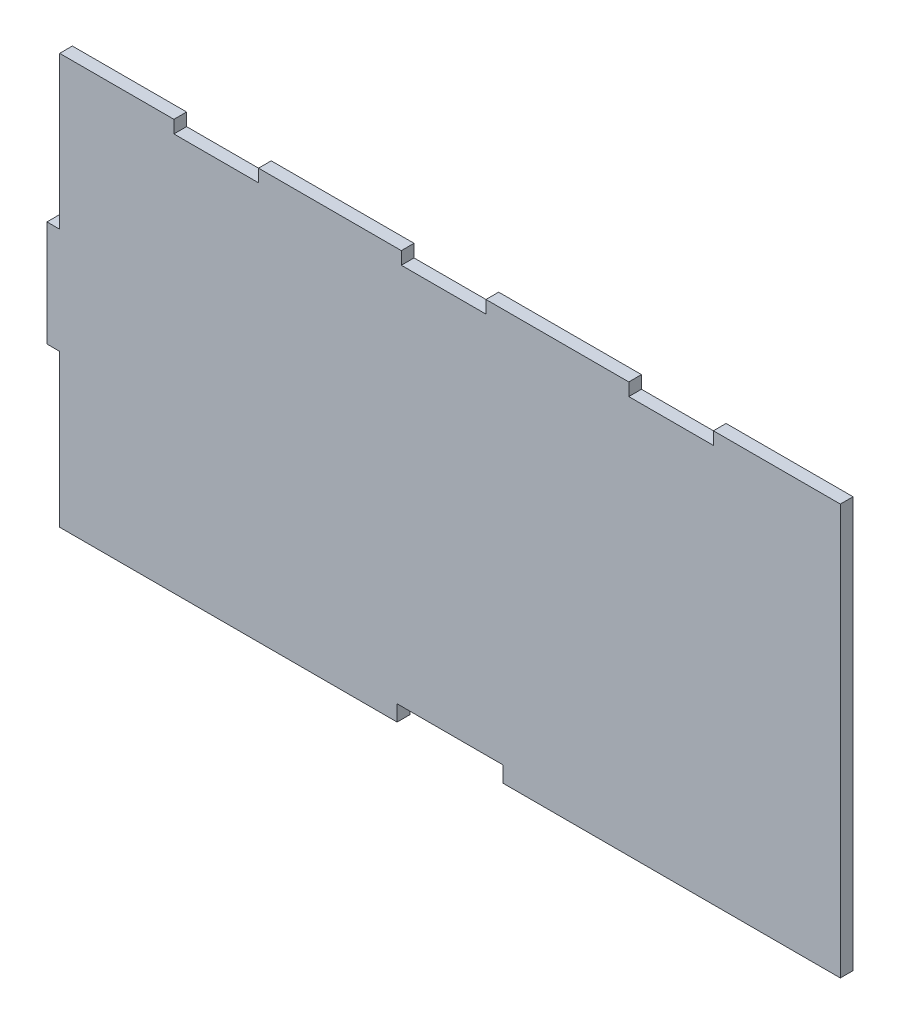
from build123d import *

# Parameters (mm, degrees)
SALIENTE_EXTRUIR1_DEPTH = 12


with BuildPart() as part:
    # Croquis1 → Saliente-Extruir1 (new body)
    with BuildSketch(Plane.XY):
        Polygon((-261, 194), (-369, 194), (-369, 50), (-381, 50), (-381, -50), (-369, -50), (-369, -194), (-50, -194), (-50, -179), (50, -179), (50, -194), (369, -194), (369, 194), (249, 194), (249, 182), (169, 182), (169, 194), (34, 194), (34, 182), (-46, 182), (-46, 194), (-181, 194), (-181, 182), (-261, 182), align=None)
    extrude(amount=SALIENTE_EXTRUIR1_DEPTH)


solid = part.part
